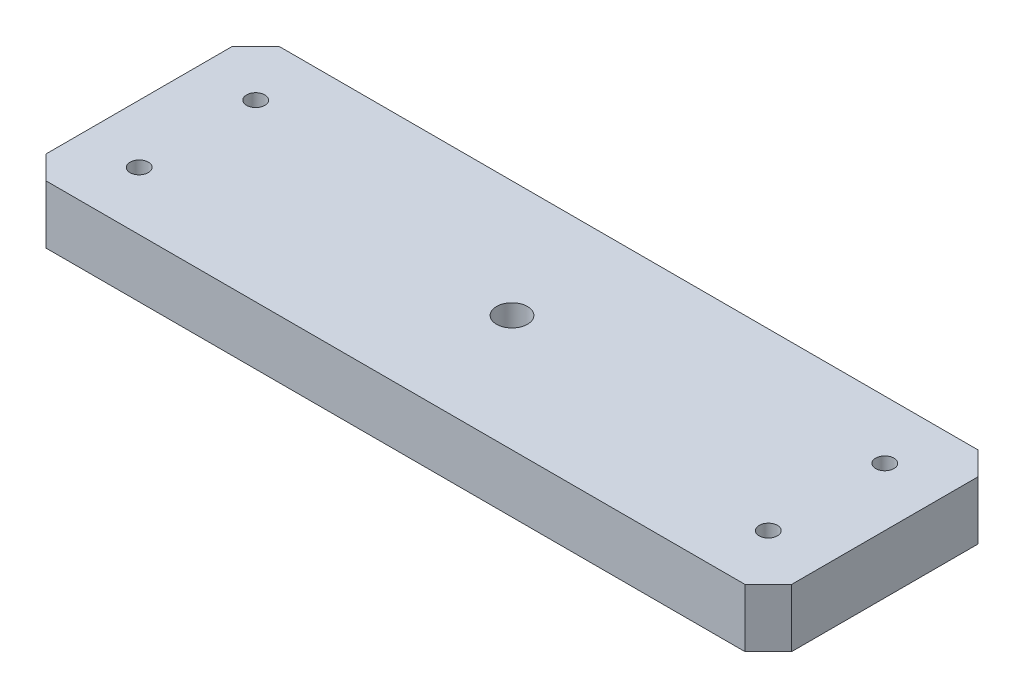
from build123d import *

# Parameters (mm, degrees)
SKETCH1_W                                         = 203.2
SKETCH1_H                                         = 63.5
BOSS_EXTRUDE1_DEPTH                               = 15.875
F_10_CLEARANCE_HOLE1_D                            = 4.9784
CHAMFER1_SIZE                                     = 6.35
CBORE_FOR_5_16_SOCKET_HEAD_CAP_SCREW1_D           = 8.4328
CBORE_FOR_5_16_SOCKET_HEAD_CAP_SCREW1_CBORE_D     = 13.49502
CBORE_FOR_5_16_SOCKET_HEAD_CAP_SCREW1_CBORE_DEPTH = 7.9375


with BuildPart() as part:
    # Sketch1 → Boss-Extrude1 (new body)
    with BuildSketch(Plane(origin=(0, 0, 0), x_dir=(1, 0, 0), z_dir=(0, 1, 0))):
        Rectangle(SKETCH1_W, SKETCH1_H)
    extrude(amount=BOSS_EXTRUDE1_DEPTH)

    # 10 Clearance Hole1 (through all)
    with Locations(Plane(origin=(0, 15.875, 0), x_dir=(-1, 0, 0), z_dir=(0, 1, 0))):
        with Locations((85.725, -15.875), (-85.725, -15.875), (-85.725, 15.875), (85.725, 15.875)):
            Hole(F_10_CLEARANCE_HOLE1_D / 2)

    # Chamfer1
    chamfer1_edges = [part.edges().sort_by_distance(p)[0] for p in [
        (101.6, 7.9375, 31.75),
        (-101.6, 7.9375, 31.75),
        (-101.6, 7.9375, -31.75),
        (101.6, 7.9375, -31.75),
    ]]
    chamfer(chamfer1_edges, length=CHAMFER1_SIZE)

    # CBORE for 5_16 Socket Head Cap Screw1 (through all)
    with Locations(Plane.XZ):
        with Locations((0, 0)):
            CounterBoreHole(CBORE_FOR_5_16_SOCKET_HEAD_CAP_SCREW1_D / 2, CBORE_FOR_5_16_SOCKET_HEAD_CAP_SCREW1_CBORE_D / 2, CBORE_FOR_5_16_SOCKET_HEAD_CAP_SCREW1_CBORE_DEPTH)


solid = part.part
